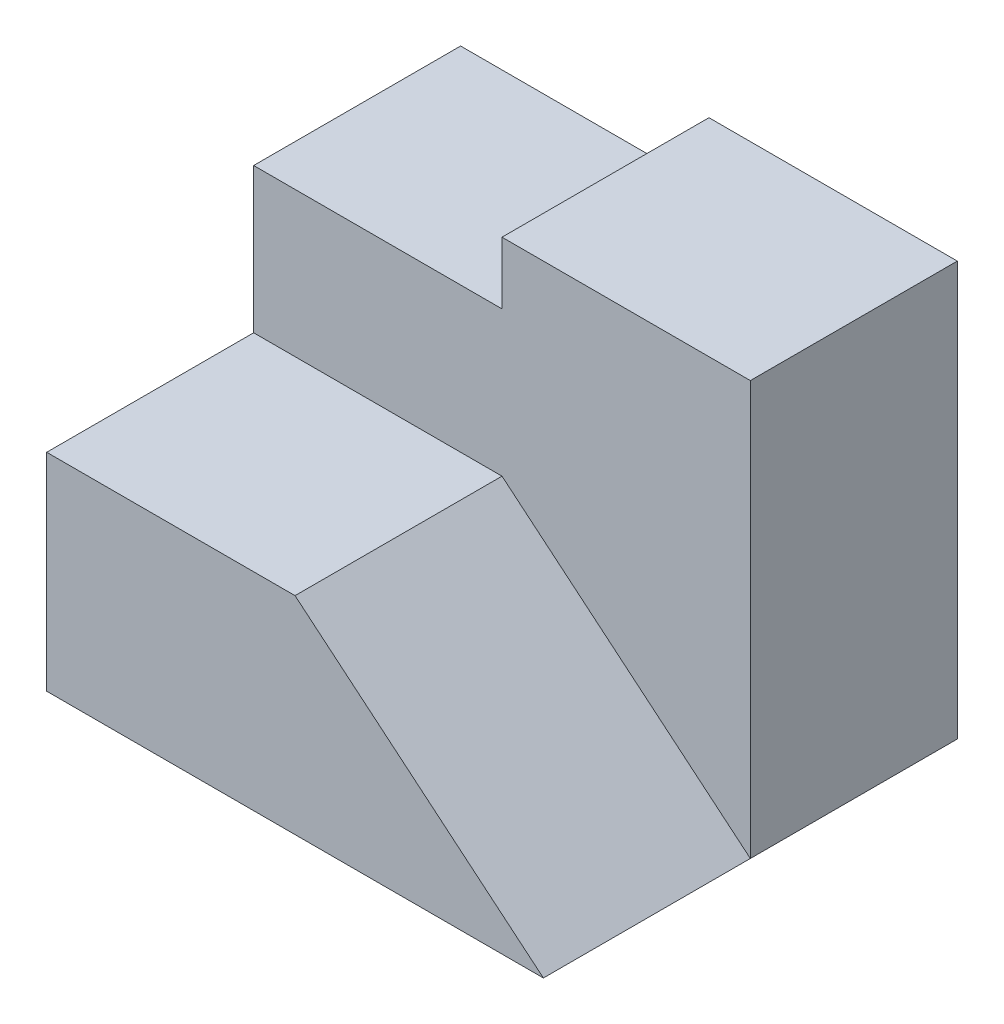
from build123d import *

# Parameters (mm, degrees)
EXTRUDE_1_DEPTH = 50
EXTRUDE_2_DEPTH = 50


with BuildPart() as part:
    # Sketch 1 → Extrude 1 (new body)
    with BuildSketch(Plane.XY):
        Polygon((0, 0), (120, 0), (60, 50), (0, 50), align=None)
    extrude(amount=-EXTRUDE_1_DEPTH)

    # Sketch 2 → Extrude 2 (add)
    with BuildSketch(Plane(origin=(0, 0, -50), x_dir=(-1, 0, 0), z_dir=(0, 0, -1))):
        Polygon((0, 0), (0, 85), (-60, 85), (-60, 100), (-120, 100), (-120, 0), align=None)
    extrude(amount=EXTRUDE_2_DEPTH)


solid = part.part
